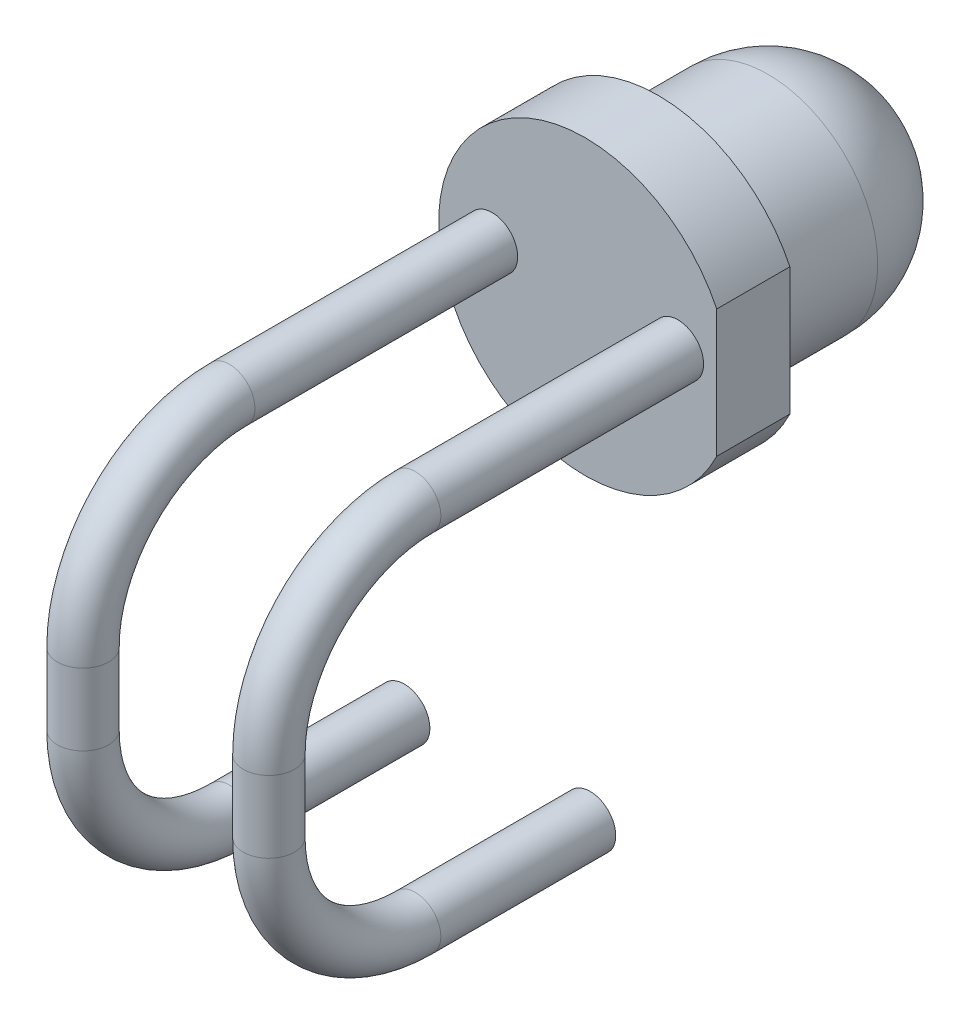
ISO-10303-21;
HEADER;
FILE_DESCRIPTION(('STEP AP214'),'2;1');
FILE_NAME('part.step','',(''),(''),'','','');
FILE_SCHEMA(('AUTOMOTIVE_DESIGN { 1 0 10303 214 1 1 1 1 }'));
ENDSEC;
DATA;
#1=APPLICATION_CONTEXT('core data for automotive mechanical design processes');
#2=APPLICATION_PROTOCOL_DEFINITION('international standard','automotive_design',2000,#1);
#3=PRODUCT_CONTEXT('',#1,'mechanical');
#4=PRODUCT('Part','Part','',(#3));
#5=PRODUCT_RELATED_PRODUCT_CATEGORY('part','',(#4));
#6=PRODUCT_DEFINITION_FORMATION('','',#4);
#7=PRODUCT_DEFINITION_CONTEXT('part definition',#1,'design');
#8=PRODUCT_DEFINITION('design','',#6,#7);
#9=PRODUCT_DEFINITION_SHAPE('','',#8);
#10=(LENGTH_UNIT() NAMED_UNIT(*) SI_UNIT(.MILLI.,.METRE.));
#11=(NAMED_UNIT(*) PLANE_ANGLE_UNIT() SI_UNIT($,.RADIAN.));
#12=(NAMED_UNIT(*) SI_UNIT($,.STERADIAN.) SOLID_ANGLE_UNIT());
#13=UNCERTAINTY_MEASURE_WITH_UNIT(LENGTH_MEASURE(1.E-05),#10,'distance_accuracy_value','');
#14=(GEOMETRIC_REPRESENTATION_CONTEXT(3) GLOBAL_UNCERTAINTY_ASSIGNED_CONTEXT((#13)) GLOBAL_UNIT_ASSIGNED_CONTEXT((#10,
#11,#12)) REPRESENTATION_CONTEXT('',''));
#15=CARTESIAN_POINT('',(0.,0.,0.));
#16=DIRECTION('',(0.,0.,1.));
#17=DIRECTION('',(1.,0.,0.));
#18=AXIS2_PLACEMENT_3D('',#15,#16,#17);
#19=CARTESIAN_POINT('',(0.,0.,4.));
#20=DIRECTION('',(0.,0.,1.));
#21=DIRECTION('',(1.,0.,0.));
#22=AXIS2_PLACEMENT_3D('',#19,#20,#21);
#23=PLANE('',#22);
#24=CARTESIAN_POINT('',(1.27,0.128695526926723,4.));
#25=DIRECTION('',(0.,0.,1.));
#26=DIRECTION('',(1.,0.,0.));
#27=AXIS2_PLACEMENT_3D('',#24,#25,#26);
#28=CIRCLE('',#27,0.35);
#29=CARTESIAN_POINT('',(1.62,0.128695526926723,4.));
#30=VERTEX_POINT('',#29);
#31=EDGE_CURVE('E217',#30,#30,#28,.T.);
#32=ORIENTED_EDGE('',*,*,#31,.F.);
#33=EDGE_LOOP('',(#32));
#34=FACE_BOUND('',#33,.T.);
#35=CARTESIAN_POINT('',(0.,0.,4.));
#36=DIRECTION('',(0.,0.,1.));
#37=DIRECTION('',(1.,0.,0.));
#38=AXIS2_PLACEMENT_3D('',#35,#36,#37);
#39=CIRCLE('',#38,2.);
#40=CARTESIAN_POINT('',(1.8,0.871779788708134,4.));
#41=VERTEX_POINT('',#40);
#42=CARTESIAN_POINT('',(1.8,-0.871779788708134,4.));
#43=VERTEX_POINT('',#42);
#44=EDGE_CURVE('E56',#41,#43,#39,.T.);
#45=ORIENTED_EDGE('',*,*,#44,.T.);
#46=DIRECTION('',(0.,1.,0.));
#47=VECTOR('',#46,1.);
#48=CARTESIAN_POINT('',(1.8,0.871779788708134,4.));
#49=LINE('',#48,#47);
#50=EDGE_CURVE('E64',#43,#41,#49,.T.);
#51=ORIENTED_EDGE('',*,*,#50,.T.);
#52=EDGE_LOOP('',(#45,#51));
#53=FACE_BOUND('',#52,.T.);
#54=CARTESIAN_POINT('',(-1.27,0.128695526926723,4.));
#55=DIRECTION('',(0.,0.,1.));
#56=DIRECTION('',(1.,0.,0.));
#57=AXIS2_PLACEMENT_3D('',#54,#55,#56);
#58=CIRCLE('',#57,0.35);
#59=CARTESIAN_POINT('',(-0.92,0.128695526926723,4.));
#60=VERTEX_POINT('',#59);
#61=EDGE_CURVE('E258',#60,#60,#58,.T.);
#62=ORIENTED_EDGE('',*,*,#61,.F.);
#63=EDGE_LOOP('',(#62));
#64=FACE_BOUND('',#63,.T.);
#65=ADVANCED_FACE('F27',(#34,#53,#64),#23,.T.);
#66=CARTESIAN_POINT('',(0.,0.,4.));
#67=DIRECTION('',(0.,0.,-1.));
#68=DIRECTION('',(-1.,0.,0.));
#69=AXIS2_PLACEMENT_3D('',#66,#67,#68);
#70=CYLINDRICAL_SURFACE('',#69,1.5);
#71=CARTESIAN_POINT('',(0.,0.,1.5));
#72=DIRECTION('',(0.,0.,-1.));
#73=DIRECTION('',(-1.,0.,0.));
#74=AXIS2_PLACEMENT_3D('',#71,#72,#73);
#75=CIRCLE('',#74,1.5);
#76=CARTESIAN_POINT('',(-1.5,0.,1.5));
#77=VERTEX_POINT('',#76);
#78=EDGE_CURVE('E11',#77,#77,#75,.F.);
#79=ORIENTED_EDGE('',*,*,#78,.T.);
#80=EDGE_LOOP('',(#79));
#81=FACE_BOUND('',#80,.T.);
#82=CARTESIAN_POINT('',(0.,0.,3.));
#83=DIRECTION('',(0.,0.,1.));
#84=DIRECTION('',(1.,0.,0.));
#85=AXIS2_PLACEMENT_3D('',#82,#83,#84);
#86=CIRCLE('',#85,1.5);
#87=CARTESIAN_POINT('',(1.5,0.,3.));
#88=VERTEX_POINT('',#87);
#89=EDGE_CURVE('E35',#88,#88,#86,.T.);
#90=ORIENTED_EDGE('',*,*,#89,.F.);
#91=EDGE_LOOP('',(#90));
#92=FACE_BOUND('',#91,.T.);
#93=ADVANCED_FACE('F29',(#81,#92),#70,.T.);
#94=CARTESIAN_POINT('',(0.,0.,3.));
#95=DIRECTION('',(0.,0.,1.));
#96=DIRECTION('',(1.,0.,0.));
#97=AXIS2_PLACEMENT_3D('',#94,#95,#96);
#98=PLANE('',#97);
#99=CARTESIAN_POINT('',(0.,0.,3.));
#100=DIRECTION('',(0.,0.,1.));
#101=DIRECTION('',(1.,0.,0.));
#102=AXIS2_PLACEMENT_3D('',#99,#100,#101);
#103=CIRCLE('',#102,2.);
#104=CARTESIAN_POINT('',(1.8,0.871779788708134,3.));
#105=VERTEX_POINT('',#104);
#106=CARTESIAN_POINT('',(1.8,-0.871779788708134,3.));
#107=VERTEX_POINT('',#106);
#108=EDGE_CURVE('E58',#105,#107,#103,.T.);
#109=ORIENTED_EDGE('',*,*,#108,.F.);
#110=DIRECTION('',(0.,1.,0.));
#111=VECTOR('',#110,1.);
#112=CARTESIAN_POINT('',(1.8,0.871779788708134,3.));
#113=LINE('',#112,#111);
#114=EDGE_CURVE('E60',#107,#105,#113,.T.);
#115=ORIENTED_EDGE('',*,*,#114,.F.);
#116=EDGE_LOOP('',(#109,#115));
#117=FACE_BOUND('',#116,.T.);
#118=ORIENTED_EDGE('',*,*,#89,.T.);
#119=EDGE_LOOP('',(#118));
#120=FACE_BOUND('',#119,.T.);
#121=ADVANCED_FACE('F76',(#117,#120),#98,.F.);
#122=CARTESIAN_POINT('',(0.,0.,3.));
#123=DIRECTION('',(0.,0.,1.));
#124=DIRECTION('',(1.,0.,0.));
#125=AXIS2_PLACEMENT_3D('',#122,#123,#124);
#126=CYLINDRICAL_SURFACE('',#125,2.);
#127=ORIENTED_EDGE('',*,*,#44,.F.);
#128=DIRECTION('',(0.,0.,1.));
#129=VECTOR('',#128,1.);
#130=CARTESIAN_POINT('',(1.8,0.871779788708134,3.));
#131=LINE('',#130,#129);
#132=EDGE_CURVE('E42',#105,#41,#131,.T.);
#133=ORIENTED_EDGE('',*,*,#132,.F.);
#134=ORIENTED_EDGE('',*,*,#108,.T.);
#135=DIRECTION('',(0.,0.,1.));
#136=VECTOR('',#135,1.);
#137=CARTESIAN_POINT('',(1.8,-0.871779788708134,3.));
#138=LINE('',#137,#136);
#139=EDGE_CURVE('E50',#107,#43,#138,.T.);
#140=ORIENTED_EDGE('',*,*,#139,.T.);
#141=EDGE_LOOP('',(#127,#133,#134,#140));
#142=FACE_BOUND('',#141,.T.);
#143=ADVANCED_FACE('F55',(#142),#126,.T.);
#144=CARTESIAN_POINT('',(1.8,0.871779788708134,3.));
#145=DIRECTION('',(1.,0.,0.));
#146=DIRECTION('',(0.,0.,-1.));
#147=AXIS2_PLACEMENT_3D('',#144,#145,#146);
#148=PLANE('',#147);
#149=ORIENTED_EDGE('',*,*,#50,.F.);
#150=ORIENTED_EDGE('',*,*,#139,.F.);
#151=ORIENTED_EDGE('',*,*,#114,.T.);
#152=ORIENTED_EDGE('',*,*,#132,.T.);
#153=EDGE_LOOP('',(#149,#150,#151,#152));
#154=FACE_BOUND('',#153,.T.);
#155=ADVANCED_FACE('F67',(#154),#148,.T.);
#156=CARTESIAN_POINT('',(0.,0.,1.5));
#157=DIRECTION('',(0.,0.,1.));
#158=DIRECTION('',(1.,0.,0.));
#159=AXIS2_PLACEMENT_3D('',#156,#157,#158);
#160=SPHERICAL_SURFACE('',#159,1.5);
#161=ORIENTED_EDGE('',*,*,#78,.F.);
#162=EDGE_LOOP('',(#161));
#163=FACE_BOUND('',#162,.T.);
#164=ADVANCED_FACE('F91',(#163),#160,.T.);
#165=CARTESIAN_POINT('',(1.27,-4.85130447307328,7.58999999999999));
#166=DIRECTION('',(0.,0.,-1.));
#167=DIRECTION('',(0.,1.,0.));
#168=AXIS2_PLACEMENT_3D('',#165,#166,#167);
#169=CYLINDRICAL_SURFACE('',#168,0.35);
#170=CARTESIAN_POINT('',(1.27,-4.85130447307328,7.58999999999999));
#171=DIRECTION('',(0.,0.,-1.));
#172=DIRECTION('',(1.,0.,0.));
#173=AXIS2_PLACEMENT_3D('',#170,#171,#172);
#174=CIRCLE('',#173,0.35);
#175=CARTESIAN_POINT('',(1.27,-5.20130447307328,7.58999999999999));
#176=VERTEX_POINT('',#175);
#177=EDGE_CURVE('E236',#176,#176,#174,.T.);
#178=ORIENTED_EDGE('',*,*,#177,.T.);
#179=EDGE_LOOP('',(#178));
#180=FACE_BOUND('',#179,.T.);
#181=CARTESIAN_POINT('',(1.27,-4.85130447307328,5.2));
#182=DIRECTION('',(0.,0.,-1.));
#183=DIRECTION('',(1.,0.,0.));
#184=AXIS2_PLACEMENT_3D('',#181,#182,#183);
#185=CIRCLE('',#184,0.35);
#186=CARTESIAN_POINT('',(1.62,-4.85130447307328,5.2));
#187=VERTEX_POINT('',#186);
#188=EDGE_CURVE('E65',#187,#187,#185,.T.);
#189=ORIENTED_EDGE('',*,*,#188,.F.);
#190=EDGE_LOOP('',(#189));
#191=FACE_BOUND('',#190,.T.);
#192=ADVANCED_FACE('F92',(#180,#191),#169,.T.);
#193=CARTESIAN_POINT('',(1.27,-2.85130447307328,7.59));
#194=DIRECTION('',(1.,0.,0.));
#195=DIRECTION('',(0.,0.,-1.));
#196=AXIS2_PLACEMENT_3D('',#193,#194,#195);
#197=TOROIDAL_SURFACE('',#196,2.,0.35);
#198=CARTESIAN_POINT('',(1.27,-2.85130447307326,9.59));
#199=DIRECTION('',(0.,-1.,0.));
#200=DIRECTION('',(1.,0.,0.));
#201=AXIS2_PLACEMENT_3D('',#198,#199,#200);
#202=CIRCLE('',#201,0.35);
#203=CARTESIAN_POINT('',(1.27,-2.85130447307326,9.94));
#204=VERTEX_POINT('',#203);
#205=EDGE_CURVE('E233',#204,#204,#202,.T.);
#206=CARTESIAN_POINT('',(1.27,-2.85130447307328,7.59));
#207=DIRECTION('',(1.,0.,0.));
#208=DIRECTION('',(0.,0.,-1.));
#209=AXIS2_PLACEMENT_3D('',#206,#207,#208);
#210=CIRCLE('',#209,2.35);
#211=EDGE_CURVE('',#204,#176,#210,.T.);
#212=ORIENTED_EDGE('',*,*,#205,.T.);
#213=ORIENTED_EDGE('',*,*,#177,.F.);
#214=ORIENTED_EDGE('',*,*,#211,.T.);
#215=ORIENTED_EDGE('',*,*,#211,.F.);
#216=EDGE_LOOP('',(#212,#214,#213,#215));
#217=FACE_BOUND('',#216,.T.);
#218=ADVANCED_FACE('F97',(#217),#197,.T.);
#219=CARTESIAN_POINT('',(1.27,-1.87130447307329,9.59));
#220=DIRECTION('',(0.,-1.,0.));
#221=DIRECTION('',(0.,0.,-1.));
#222=AXIS2_PLACEMENT_3D('',#219,#220,#221);
#223=CYLINDRICAL_SURFACE('',#222,0.35);
#224=CARTESIAN_POINT('',(1.27,-1.87130447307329,9.59));
#225=DIRECTION('',(0.,-1.,0.));
#226=DIRECTION('',(1.,0.,0.));
#227=AXIS2_PLACEMENT_3D('',#224,#225,#226);
#228=CIRCLE('',#227,0.35);
#229=CARTESIAN_POINT('',(1.27,-1.87130447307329,9.94));
#230=VERTEX_POINT('',#229);
#231=EDGE_CURVE('E230',#230,#230,#228,.T.);
#232=ORIENTED_EDGE('',*,*,#231,.T.);
#233=EDGE_LOOP('',(#232));
#234=FACE_BOUND('',#233,.T.);
#235=ORIENTED_EDGE('',*,*,#205,.F.);
#236=EDGE_LOOP('',(#235));
#237=FACE_BOUND('',#236,.T.);
#238=ADVANCED_FACE('F125',(#234,#237),#223,.T.);
#239=CARTESIAN_POINT('',(1.27,-1.87130447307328,7.59));
#240=DIRECTION('',(1.,0.,0.));
#241=DIRECTION('',(0.,0.,-1.));
#242=AXIS2_PLACEMENT_3D('',#239,#240,#241);
#243=TOROIDAL_SURFACE('',#242,2.,0.35);
#244=CARTESIAN_POINT('',(1.27,0.128695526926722,7.58999999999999));
#245=DIRECTION('',(0.,0.,1.));
#246=DIRECTION('',(1.,0.,0.));
#247=AXIS2_PLACEMENT_3D('',#244,#245,#246);
#248=CIRCLE('',#247,0.35);
#249=CARTESIAN_POINT('',(1.27,0.478695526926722,7.58999999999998));
#250=VERTEX_POINT('',#249);
#251=EDGE_CURVE('E221',#250,#250,#248,.T.);
#252=CARTESIAN_POINT('',(1.27,-1.87130447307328,7.59));
#253=DIRECTION('',(1.,0.,0.));
#254=DIRECTION('',(0.,0.,-1.));
#255=AXIS2_PLACEMENT_3D('',#252,#253,#254);
#256=CIRCLE('',#255,2.35);
#257=EDGE_CURVE('',#250,#230,#256,.T.);
#258=ORIENTED_EDGE('',*,*,#251,.T.);
#259=ORIENTED_EDGE('',*,*,#231,.F.);
#260=ORIENTED_EDGE('',*,*,#257,.T.);
#261=ORIENTED_EDGE('',*,*,#257,.F.);
#262=EDGE_LOOP('',(#258,#260,#259,#261));
#263=FACE_BOUND('',#262,.T.);
#264=ADVANCED_FACE('F132',(#263),#243,.T.);
#265=CARTESIAN_POINT('',(1.27,0.128695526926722,7.58999999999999));
#266=DIRECTION('',(0.,0.,-1.));
#267=DIRECTION('',(0.,1.,0.));
#268=AXIS2_PLACEMENT_3D('',#265,#266,#267);
#269=CYLINDRICAL_SURFACE('',#268,0.35);
#270=ORIENTED_EDGE('',*,*,#251,.F.);
#271=EDGE_LOOP('',(#270));
#272=FACE_BOUND('',#271,.T.);
#273=ORIENTED_EDGE('',*,*,#31,.T.);
#274=EDGE_LOOP('',(#273));
#275=FACE_BOUND('',#274,.T.);
#276=ADVANCED_FACE('F140',(#272,#275),#269,.T.);
#277=CARTESIAN_POINT('',(1.27,-4.85130447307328,5.2));
#278=DIRECTION('',(0.,0.,-1.));
#279=DIRECTION('',(1.,0.,0.));
#280=AXIS2_PLACEMENT_3D('',#277,#278,#279);
#281=PLANE('',#280);
#282=ORIENTED_EDGE('',*,*,#188,.T.);
#283=EDGE_LOOP('',(#282));
#284=FACE_BOUND('',#283,.T.);
#285=ADVANCED_FACE('F148',(#284),#281,.T.);
#286=CARTESIAN_POINT('',(-1.27,-4.85130447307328,7.58999999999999));
#287=DIRECTION('',(0.,0.,-1.));
#288=DIRECTION('',(0.,1.,0.));
#289=AXIS2_PLACEMENT_3D('',#286,#287,#288);
#290=CYLINDRICAL_SURFACE('',#289,0.35);
#291=CARTESIAN_POINT('',(-1.27,-4.85130447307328,7.58999999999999));
#292=DIRECTION('',(0.,0.,-1.));
#293=DIRECTION('',(1.,0.,0.));
#294=AXIS2_PLACEMENT_3D('',#291,#292,#293);
#295=CIRCLE('',#294,0.35);
#296=CARTESIAN_POINT('',(-1.27,-5.20130447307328,7.58999999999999));
#297=VERTEX_POINT('',#296);
#298=EDGE_CURVE('E218',#297,#297,#295,.T.);
#299=ORIENTED_EDGE('',*,*,#298,.T.);
#300=EDGE_LOOP('',(#299));
#301=FACE_BOUND('',#300,.T.);
#302=CARTESIAN_POINT('',(-1.27,-4.85130447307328,5.2));
#303=DIRECTION('',(0.,0.,-1.));
#304=DIRECTION('',(1.,0.,0.));
#305=AXIS2_PLACEMENT_3D('',#302,#303,#304);
#306=CIRCLE('',#305,0.35);
#307=CARTESIAN_POINT('',(-0.92,-4.85130447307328,5.2));
#308=VERTEX_POINT('',#307);
#309=EDGE_CURVE('E215',#308,#308,#306,.T.);
#310=ORIENTED_EDGE('',*,*,#309,.F.);
#311=EDGE_LOOP('',(#310));
#312=FACE_BOUND('',#311,.T.);
#313=ADVANCED_FACE('F156',(#301,#312),#290,.T.);
#314=CARTESIAN_POINT('',(-1.27,-2.85130447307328,7.59));
#315=DIRECTION('',(1.,0.,0.));
#316=DIRECTION('',(0.,0.,-1.));
#317=AXIS2_PLACEMENT_3D('',#314,#315,#316);
#318=TOROIDAL_SURFACE('',#317,2.,0.35);
#319=CARTESIAN_POINT('',(-1.27,-2.85130447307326,9.59));
#320=DIRECTION('',(0.,-1.,0.));
#321=DIRECTION('',(1.,0.,0.));
#322=AXIS2_PLACEMENT_3D('',#319,#320,#321);
#323=CIRCLE('',#322,0.35);
#324=CARTESIAN_POINT('',(-1.27,-2.85130447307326,9.94));
#325=VERTEX_POINT('',#324);
#326=EDGE_CURVE('E224',#325,#325,#323,.T.);
#327=CARTESIAN_POINT('',(-1.27,-2.85130447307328,7.59));
#328=DIRECTION('',(1.,0.,0.));
#329=DIRECTION('',(0.,0.,-1.));
#330=AXIS2_PLACEMENT_3D('',#327,#328,#329);
#331=CIRCLE('',#330,2.35);
#332=EDGE_CURVE('',#325,#297,#331,.T.);
#333=ORIENTED_EDGE('',*,*,#326,.T.);
#334=ORIENTED_EDGE('',*,*,#298,.F.);
#335=ORIENTED_EDGE('',*,*,#332,.T.);
#336=ORIENTED_EDGE('',*,*,#332,.F.);
#337=EDGE_LOOP('',(#333,#335,#334,#336));
#338=FACE_BOUND('',#337,.T.);
#339=ADVANCED_FACE('F171',(#338),#318,.T.);
#340=CARTESIAN_POINT('',(-1.27,-1.87130447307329,9.59));
#341=DIRECTION('',(0.,-1.,0.));
#342=DIRECTION('',(0.,0.,-1.));
#343=AXIS2_PLACEMENT_3D('',#340,#341,#342);
#344=CYLINDRICAL_SURFACE('',#343,0.35);
#345=CARTESIAN_POINT('',(-1.27,-1.87130447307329,9.59));
#346=DIRECTION('',(0.,-1.,0.));
#347=DIRECTION('',(1.,0.,0.));
#348=AXIS2_PLACEMENT_3D('',#345,#346,#347);
#349=CIRCLE('',#348,0.35);
#350=CARTESIAN_POINT('',(-1.27,-1.87130447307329,9.94));
#351=VERTEX_POINT('',#350);
#352=EDGE_CURVE('E252',#351,#351,#349,.T.);
#353=ORIENTED_EDGE('',*,*,#352,.T.);
#354=EDGE_LOOP('',(#353));
#355=FACE_BOUND('',#354,.T.);
#356=ORIENTED_EDGE('',*,*,#326,.F.);
#357=EDGE_LOOP('',(#356));
#358=FACE_BOUND('',#357,.T.);
#359=ADVANCED_FACE('F179',(#355,#358),#344,.T.);
#360=CARTESIAN_POINT('',(-1.27,-1.87130447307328,7.59));
#361=DIRECTION('',(1.,0.,0.));
#362=DIRECTION('',(0.,0.,-1.));
#363=AXIS2_PLACEMENT_3D('',#360,#361,#362);
#364=TOROIDAL_SURFACE('',#363,2.,0.35);
#365=CARTESIAN_POINT('',(-1.27,0.128695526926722,7.58999999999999));
#366=DIRECTION('',(0.,0.,1.));
#367=DIRECTION('',(1.,0.,0.));
#368=AXIS2_PLACEMENT_3D('',#365,#366,#367);
#369=CIRCLE('',#368,0.35);
#370=CARTESIAN_POINT('',(-1.27,0.478695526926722,7.58999999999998));
#371=VERTEX_POINT('',#370);
#372=EDGE_CURVE('E255',#371,#371,#369,.T.);
#373=CARTESIAN_POINT('',(-1.27,-1.87130447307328,7.59));
#374=DIRECTION('',(1.,0.,0.));
#375=DIRECTION('',(0.,0.,-1.));
#376=AXIS2_PLACEMENT_3D('',#373,#374,#375);
#377=CIRCLE('',#376,2.35);
#378=EDGE_CURVE('',#371,#351,#377,.T.);
#379=ORIENTED_EDGE('',*,*,#372,.T.);
#380=ORIENTED_EDGE('',*,*,#352,.F.);
#381=ORIENTED_EDGE('',*,*,#378,.T.);
#382=ORIENTED_EDGE('',*,*,#378,.F.);
#383=EDGE_LOOP('',(#379,#381,#380,#382));
#384=FACE_BOUND('',#383,.T.);
#385=ADVANCED_FACE('F187',(#384),#364,.T.);
#386=CARTESIAN_POINT('',(-1.27,0.128695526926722,7.58999999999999));
#387=DIRECTION('',(0.,0.,-1.));
#388=DIRECTION('',(0.,1.,0.));
#389=AXIS2_PLACEMENT_3D('',#386,#387,#388);
#390=CYLINDRICAL_SURFACE('',#389,0.35);
#391=ORIENTED_EDGE('',*,*,#372,.F.);
#392=EDGE_LOOP('',(#391));
#393=FACE_BOUND('',#392,.T.);
#394=ORIENTED_EDGE('',*,*,#61,.T.);
#395=EDGE_LOOP('',(#394));
#396=FACE_BOUND('',#395,.T.);
#397=ADVANCED_FACE('F195',(#393,#396),#390,.T.);
#398=CARTESIAN_POINT('',(-1.27,-4.85130447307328,5.2));
#399=DIRECTION('',(0.,0.,-1.));
#400=DIRECTION('',(1.,0.,0.));
#401=AXIS2_PLACEMENT_3D('',#398,#399,#400);
#402=PLANE('',#401);
#403=ORIENTED_EDGE('',*,*,#309,.T.);
#404=EDGE_LOOP('',(#403));
#405=FACE_BOUND('',#404,.T.);
#406=ADVANCED_FACE('F203',(#405),#402,.T.);
#407=CLOSED_SHELL('',(#65,#93,#121,#143,#155,#164,#192,#218,#238,#264,#276,#285,#313,#339,#359,
#385,#397,#406));
#408=MANIFOLD_SOLID_BREP('B2',#407);
#409=ADVANCED_BREP_SHAPE_REPRESENTATION('',(#18,#408),#14);
#410=SHAPE_DEFINITION_REPRESENTATION(#9,#409);
ENDSEC;
END-ISO-10303-21;
